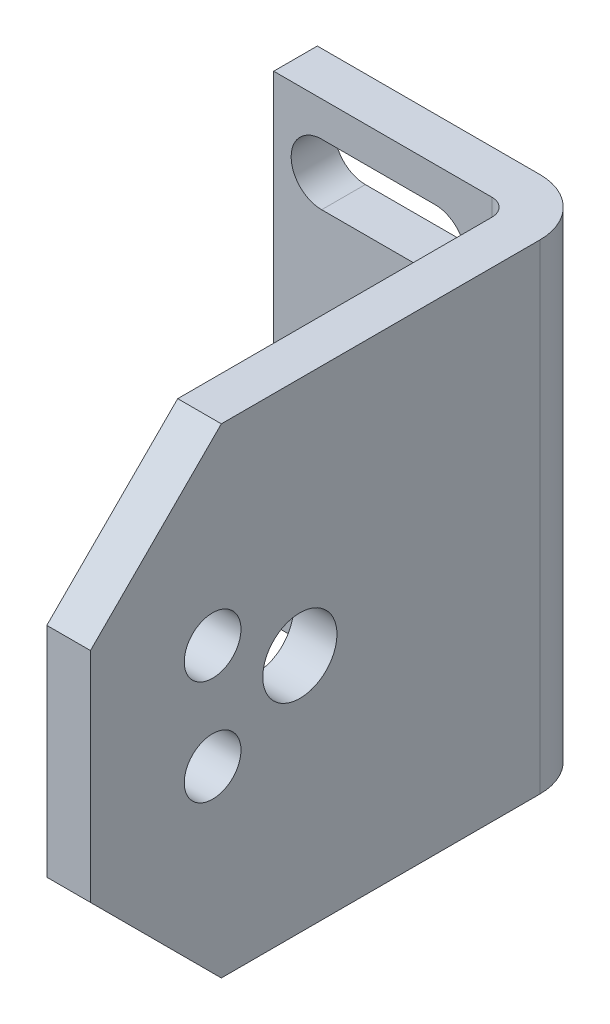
ISO-10303-21;
HEADER;
FILE_DESCRIPTION(('STEP AP214'),'2;1');
FILE_NAME('part.step','',(''),(''),'','','');
FILE_SCHEMA(('AUTOMOTIVE_DESIGN { 1 0 10303 214 1 1 1 1 }'));
ENDSEC;
DATA;
#1=APPLICATION_CONTEXT('core data for automotive mechanical design processes');
#2=APPLICATION_PROTOCOL_DEFINITION('international standard','automotive_design',2000,#1);
#3=PRODUCT_CONTEXT('',#1,'mechanical');
#4=PRODUCT('Part','Part','',(#3));
#5=PRODUCT_RELATED_PRODUCT_CATEGORY('part','',(#4));
#6=PRODUCT_DEFINITION_FORMATION('','',#4);
#7=PRODUCT_DEFINITION_CONTEXT('part definition',#1,'design');
#8=PRODUCT_DEFINITION('design','',#6,#7);
#9=PRODUCT_DEFINITION_SHAPE('','',#8);
#10=(LENGTH_UNIT() NAMED_UNIT(*) SI_UNIT(.MILLI.,.METRE.));
#11=(NAMED_UNIT(*) PLANE_ANGLE_UNIT() SI_UNIT($,.RADIAN.));
#12=(NAMED_UNIT(*) SI_UNIT($,.STERADIAN.) SOLID_ANGLE_UNIT());
#13=UNCERTAINTY_MEASURE_WITH_UNIT(LENGTH_MEASURE(1.E-05),#10,'distance_accuracy_value','');
#14=(GEOMETRIC_REPRESENTATION_CONTEXT(3) GLOBAL_UNCERTAINTY_ASSIGNED_CONTEXT((#13)) GLOBAL_UNIT_ASSIGNED_CONTEXT((#10,
#11,#12)) REPRESENTATION_CONTEXT('',''));
#15=CARTESIAN_POINT('',(0.,0.,0.));
#16=DIRECTION('',(0.,0.,1.));
#17=DIRECTION('',(1.,0.,0.));
#18=AXIS2_PLACEMENT_3D('',#15,#16,#17);
#19=CARTESIAN_POINT('',(21.5,47.5,58.));
#20=DIRECTION('',(0.,0.,-1.));
#21=DIRECTION('',(-1.,0.,0.));
#22=AXIS2_PLACEMENT_3D('',#19,#20,#21);
#23=PLANE('',#22);
#24=DIRECTION('',(0.,-1.,0.));
#25=VECTOR('',#24,1.);
#26=CARTESIAN_POINT('',(26.5,47.5,58.));
#27=LINE('',#26,#25);
#28=CARTESIAN_POINT('',(26.5,32.5,58.));
#29=VERTEX_POINT('',#28);
#30=CARTESIAN_POINT('',(26.5,7.5,58.));
#31=VERTEX_POINT('',#30);
#32=EDGE_CURVE('E252',#29,#31,#27,.T.);
#33=ORIENTED_EDGE('',*,*,#32,.F.);
#34=DIRECTION('',(-1.,0.,0.));
#35=VECTOR('',#34,1.);
#36=CARTESIAN_POINT('',(21.5,32.5,58.));
#37=LINE('',#36,#35);
#38=CARTESIAN_POINT('',(21.5,32.5,58.));
#39=VERTEX_POINT('',#38);
#40=EDGE_CURVE('E265',#29,#39,#37,.T.);
#41=ORIENTED_EDGE('',*,*,#40,.T.);
#42=DIRECTION('',(0.,-1.,0.));
#43=VECTOR('',#42,1.);
#44=CARTESIAN_POINT('',(21.5,47.5,58.));
#45=LINE('',#44,#43);
#46=CARTESIAN_POINT('',(21.5,7.5,58.));
#47=VERTEX_POINT('',#46);
#48=EDGE_CURVE('E217',#39,#47,#45,.T.);
#49=ORIENTED_EDGE('',*,*,#48,.T.);
#50=DIRECTION('',(1.,0.,0.));
#51=VECTOR('',#50,1.);
#52=CARTESIAN_POINT('',(21.5,7.5,58.));
#53=LINE('',#52,#51);
#54=EDGE_CURVE('E262',#47,#31,#53,.T.);
#55=ORIENTED_EDGE('',*,*,#54,.T.);
#56=EDGE_LOOP('',(#33,#41,#49,#55));
#57=FACE_BOUND('',#56,.T.);
#58=ADVANCED_FACE('F14',(#57),#23,.F.);
#59=CARTESIAN_POINT('',(26.5,47.5,58.));
#60=DIRECTION('',(-1.,0.,0.));
#61=DIRECTION('',(0.,0.,1.));
#62=AXIS2_PLACEMENT_3D('',#59,#60,#61);
#63=PLANE('',#62);
#64=CARTESIAN_POINT('',(26.5,14.,44.));
#65=DIRECTION('',(1.,0.,0.));
#66=DIRECTION('',(0.,-1.,0.));
#67=AXIS2_PLACEMENT_3D('',#64,#65,#66);
#68=CIRCLE('',#67,3.25);
#69=CARTESIAN_POINT('',(26.5,10.75,44.));
#70=VERTEX_POINT('',#69);
#71=EDGE_CURVE('E182',#70,#70,#68,.T.);
#72=ORIENTED_EDGE('',*,*,#71,.F.);
#73=EDGE_LOOP('',(#72));
#74=FACE_BOUND('',#73,.T.);
#75=CARTESIAN_POINT('',(26.5,26.,44.));
#76=DIRECTION('',(1.,0.,0.));
#77=DIRECTION('',(0.,1.,0.));
#78=AXIS2_PLACEMENT_3D('',#75,#76,#77);
#79=CIRCLE('',#78,3.25);
#80=CARTESIAN_POINT('',(26.5,29.25,44.));
#81=VERTEX_POINT('',#80);
#82=EDGE_CURVE('E193',#81,#81,#79,.T.);
#83=ORIENTED_EDGE('',*,*,#82,.F.);
#84=EDGE_LOOP('',(#83));
#85=FACE_BOUND('',#84,.T.);
#86=CARTESIAN_POINT('',(26.5,20.,34.));
#87=DIRECTION('',(1.,0.,0.));
#88=DIRECTION('',(0.,1.,0.));
#89=AXIS2_PLACEMENT_3D('',#86,#87,#88);
#90=CIRCLE('',#89,4.25);
#91=CARTESIAN_POINT('',(26.5,24.25,34.));
#92=VERTEX_POINT('',#91);
#93=EDGE_CURVE('E197',#92,#92,#90,.T.);
#94=ORIENTED_EDGE('',*,*,#93,.F.);
#95=EDGE_LOOP('',(#94));
#96=FACE_BOUND('',#95,.T.);
#97=DIRECTION('',(0.,0.,-1.));
#98=VECTOR('',#97,1.);
#99=CARTESIAN_POINT('',(26.5,47.5,58.));
#100=LINE('',#99,#98);
#101=CARTESIAN_POINT('',(26.5,47.5,43.));
#102=VERTEX_POINT('',#101);
#103=CARTESIAN_POINT('',(26.5,47.5,6.5));
#104=VERTEX_POINT('',#103);
#105=EDGE_CURVE('E201',#102,#104,#100,.T.);
#106=ORIENTED_EDGE('',*,*,#105,.F.);
#107=DIRECTION('',(0.,-0.707106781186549,0.707106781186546));
#108=VECTOR('',#107,1.);
#109=CARTESIAN_POINT('',(26.5,47.5,43.));
#110=LINE('',#109,#108);
#111=EDGE_CURVE('E260',#102,#29,#110,.T.);
#112=ORIENTED_EDGE('',*,*,#111,.T.);
#113=ORIENTED_EDGE('',*,*,#32,.T.);
#114=DIRECTION('',(0.,0.707106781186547,0.707106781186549));
#115=VECTOR('',#114,1.);
#116=CARTESIAN_POINT('',(26.5,7.5,58.));
#117=LINE('',#116,#115);
#118=CARTESIAN_POINT('',(26.5,-7.5,43.));
#119=VERTEX_POINT('',#118);
#120=EDGE_CURVE('E258',#31,#119,#117,.F.);
#121=ORIENTED_EDGE('',*,*,#120,.T.);
#122=DIRECTION('',(0.,0.,-1.));
#123=VECTOR('',#122,1.);
#124=CARTESIAN_POINT('',(26.5,-7.5,58.));
#125=LINE('',#124,#123);
#126=CARTESIAN_POINT('',(26.5,-7.5,6.5));
#127=VERTEX_POINT('',#126);
#128=EDGE_CURVE('E218',#119,#127,#125,.T.);
#129=ORIENTED_EDGE('',*,*,#128,.T.);
#130=DIRECTION('',(0.,-1.,0.));
#131=VECTOR('',#130,1.);
#132=CARTESIAN_POINT('',(26.5,47.5,6.5));
#133=LINE('',#132,#131);
#134=EDGE_CURVE('E249',#104,#127,#133,.T.);
#135=ORIENTED_EDGE('',*,*,#134,.F.);
#136=EDGE_LOOP('',(#106,#112,#113,#121,#129,#135));
#137=FACE_BOUND('',#136,.T.);
#138=ADVANCED_FACE('F313',(#74,#85,#96,#137),#63,.F.);
#139=CARTESIAN_POINT('',(20.,47.5,6.5));
#140=DIRECTION('',(0.,-1.,0.));
#141=DIRECTION('',(1.,0.,0.));
#142=AXIS2_PLACEMENT_3D('',#139,#140,#141);
#143=CYLINDRICAL_SURFACE('',#142,6.5);
#144=CARTESIAN_POINT('',(20.,-7.5,6.5));
#145=DIRECTION('',(0.,1.,0.));
#146=DIRECTION('',(-1.,0.,0.));
#147=AXIS2_PLACEMENT_3D('',#144,#145,#146);
#148=CIRCLE('',#147,6.5);
#149=CARTESIAN_POINT('',(20.,-7.5,0.));
#150=VERTEX_POINT('',#149);
#151=EDGE_CURVE('E220',#127,#150,#148,.T.);
#152=ORIENTED_EDGE('',*,*,#151,.T.);
#153=DIRECTION('',(0.,-1.,0.));
#154=VECTOR('',#153,1.);
#155=CARTESIAN_POINT('',(20.,47.5,0.));
#156=LINE('',#155,#154);
#157=CARTESIAN_POINT('',(20.,47.5,0.));
#158=VERTEX_POINT('',#157);
#159=EDGE_CURVE('E246',#158,#150,#156,.T.);
#160=ORIENTED_EDGE('',*,*,#159,.F.);
#161=CARTESIAN_POINT('',(20.,47.5,6.5));
#162=DIRECTION('',(0.,1.,0.));
#163=DIRECTION('',(-1.,0.,0.));
#164=AXIS2_PLACEMENT_3D('',#161,#162,#163);
#165=CIRCLE('',#164,6.5);
#166=EDGE_CURVE('E203',#104,#158,#165,.T.);
#167=ORIENTED_EDGE('',*,*,#166,.F.);
#168=ORIENTED_EDGE('',*,*,#134,.T.);
#169=EDGE_LOOP('',(#152,#160,#167,#168));
#170=FACE_BOUND('',#169,.T.);
#171=ADVANCED_FACE('F320',(#170),#143,.T.);
#172=CARTESIAN_POINT('',(20.,47.5,0.));
#173=DIRECTION('',(0.,0.,1.));
#174=DIRECTION('',(1.,0.,0.));
#175=AXIS2_PLACEMENT_3D('',#172,#173,#174);
#176=PLANE('',#175);
#177=DIRECTION('',(-1.,0.,0.));
#178=VECTOR('',#177,1.);
#179=CARTESIAN_POINT('',(13.,3.5,0.));
#180=LINE('',#179,#178);
#181=CARTESIAN_POINT('',(13.,3.5,0.));
#182=VERTEX_POINT('',#181);
#183=CARTESIAN_POINT('',(0.,3.5,0.));
#184=VERTEX_POINT('',#183);
#185=EDGE_CURVE('E146',#182,#184,#180,.T.);
#186=ORIENTED_EDGE('',*,*,#185,.T.);
#187=CARTESIAN_POINT('',(0.,0.,0.));
#188=DIRECTION('',(0.,0.,1.));
#189=DIRECTION('',(-1.,0.,0.));
#190=AXIS2_PLACEMENT_3D('',#187,#188,#189);
#191=CIRCLE('',#190,3.5);
#192=CARTESIAN_POINT('',(0.,-3.5,0.));
#193=VERTEX_POINT('',#192);
#194=EDGE_CURVE('E142',#184,#193,#191,.T.);
#195=ORIENTED_EDGE('',*,*,#194,.T.);
#196=DIRECTION('',(1.,0.,0.));
#197=VECTOR('',#196,1.);
#198=CARTESIAN_POINT('',(13.,-3.5,0.));
#199=LINE('',#198,#197);
#200=CARTESIAN_POINT('',(13.,-3.5,0.));
#201=VERTEX_POINT('',#200);
#202=EDGE_CURVE('E149',#193,#201,#199,.T.);
#203=ORIENTED_EDGE('',*,*,#202,.T.);
#204=CARTESIAN_POINT('',(13.,0.,0.));
#205=DIRECTION('',(0.,0.,1.));
#206=DIRECTION('',(-1.,0.,0.));
#207=AXIS2_PLACEMENT_3D('',#204,#205,#206);
#208=CIRCLE('',#207,3.5);
#209=EDGE_CURVE('E29',#201,#182,#208,.T.);
#210=ORIENTED_EDGE('',*,*,#209,.T.);
#211=EDGE_LOOP('',(#186,#195,#203,#210));
#212=FACE_BOUND('',#211,.T.);
#213=DIRECTION('',(1.,0.,0.));
#214=VECTOR('',#213,1.);
#215=CARTESIAN_POINT('',(13.,36.5,0.));
#216=LINE('',#215,#214);
#217=CARTESIAN_POINT('',(0.,36.5,0.));
#218=VERTEX_POINT('',#217);
#219=CARTESIAN_POINT('',(13.,36.5,0.));
#220=VERTEX_POINT('',#219);
#221=EDGE_CURVE('E175',#218,#220,#216,.T.);
#222=ORIENTED_EDGE('',*,*,#221,.T.);
#223=CARTESIAN_POINT('',(13.,40.,0.));
#224=DIRECTION('',(0.,0.,1.));
#225=DIRECTION('',(1.,0.,0.));
#226=AXIS2_PLACEMENT_3D('',#223,#224,#225);
#227=CIRCLE('',#226,3.5);
#228=CARTESIAN_POINT('',(13.,43.5,0.));
#229=VERTEX_POINT('',#228);
#230=EDGE_CURVE('E162',#220,#229,#227,.T.);
#231=ORIENTED_EDGE('',*,*,#230,.T.);
#232=DIRECTION('',(-1.,0.,0.));
#233=VECTOR('',#232,1.);
#234=CARTESIAN_POINT('',(13.,43.5,0.));
#235=LINE('',#234,#233);
#236=CARTESIAN_POINT('',(0.,43.5,0.));
#237=VERTEX_POINT('',#236);
#238=EDGE_CURVE('E169',#229,#237,#235,.T.);
#239=ORIENTED_EDGE('',*,*,#238,.T.);
#240=CARTESIAN_POINT('',(0.,40.,0.));
#241=DIRECTION('',(0.,0.,1.));
#242=DIRECTION('',(1.,0.,0.));
#243=AXIS2_PLACEMENT_3D('',#240,#241,#242);
#244=CIRCLE('',#243,3.5);
#245=EDGE_CURVE('E172',#237,#218,#244,.T.);
#246=ORIENTED_EDGE('',*,*,#245,.T.);
#247=EDGE_LOOP('',(#222,#231,#239,#246));
#248=FACE_BOUND('',#247,.T.);
#249=DIRECTION('',(-1.,0.,0.));
#250=VECTOR('',#249,1.);
#251=CARTESIAN_POINT('',(20.,-7.5,0.));
#252=LINE('',#251,#250);
#253=CARTESIAN_POINT('',(-5.5,-7.5,0.));
#254=VERTEX_POINT('',#253);
#255=EDGE_CURVE('E222',#150,#254,#252,.T.);
#256=ORIENTED_EDGE('',*,*,#255,.T.);
#257=DIRECTION('',(0.,-1.,0.));
#258=VECTOR('',#257,1.);
#259=CARTESIAN_POINT('',(-5.5,47.5,0.));
#260=LINE('',#259,#258);
#261=CARTESIAN_POINT('',(-5.5,47.5,0.));
#262=VERTEX_POINT('',#261);
#263=EDGE_CURVE('E243',#262,#254,#260,.T.);
#264=ORIENTED_EDGE('',*,*,#263,.F.);
#265=DIRECTION('',(-1.,0.,0.));
#266=VECTOR('',#265,1.);
#267=CARTESIAN_POINT('',(20.,47.5,0.));
#268=LINE('',#267,#266);
#269=EDGE_CURVE('E206',#158,#262,#268,.T.);
#270=ORIENTED_EDGE('',*,*,#269,.F.);
#271=ORIENTED_EDGE('',*,*,#159,.T.);
#272=EDGE_LOOP('',(#256,#264,#270,#271));
#273=FACE_BOUND('',#272,.T.);
#274=ADVANCED_FACE('F153',(#212,#248,#273),#176,.F.);
#275=CARTESIAN_POINT('',(-5.5,47.5,0.));
#276=DIRECTION('',(1.,0.,0.));
#277=DIRECTION('',(0.,1.,0.));
#278=AXIS2_PLACEMENT_3D('',#275,#276,#277);
#279=PLANE('',#278);
#280=DIRECTION('',(0.,0.,1.));
#281=VECTOR('',#280,1.);
#282=CARTESIAN_POINT('',(-5.5,-7.5,0.));
#283=LINE('',#282,#281);
#284=CARTESIAN_POINT('',(-5.5,-7.5,5.));
#285=VERTEX_POINT('',#284);
#286=EDGE_CURVE('E224',#254,#285,#283,.T.);
#287=ORIENTED_EDGE('',*,*,#286,.T.);
#288=DIRECTION('',(0.,-1.,0.));
#289=VECTOR('',#288,1.);
#290=CARTESIAN_POINT('',(-5.5,47.5,5.));
#291=LINE('',#290,#289);
#292=CARTESIAN_POINT('',(-5.5,47.5,5.));
#293=VERTEX_POINT('',#292);
#294=EDGE_CURVE('E240',#293,#285,#291,.T.);
#295=ORIENTED_EDGE('',*,*,#294,.F.);
#296=DIRECTION('',(0.,0.,1.));
#297=VECTOR('',#296,1.);
#298=CARTESIAN_POINT('',(-5.5,47.5,0.));
#299=LINE('',#298,#297);
#300=EDGE_CURVE('E208',#262,#293,#299,.T.);
#301=ORIENTED_EDGE('',*,*,#300,.F.);
#302=ORIENTED_EDGE('',*,*,#263,.T.);
#303=EDGE_LOOP('',(#287,#295,#301,#302));
#304=FACE_BOUND('',#303,.T.);
#305=ADVANCED_FACE('F375',(#304),#279,.F.);
#306=CARTESIAN_POINT('',(-5.5,47.5,5.));
#307=DIRECTION('',(0.,0.,-1.));
#308=DIRECTION('',(-1.,0.,0.));
#309=AXIS2_PLACEMENT_3D('',#306,#307,#308);
#310=PLANE('',#309);
#311=DIRECTION('',(-1.,0.,0.));
#312=VECTOR('',#311,1.);
#313=CARTESIAN_POINT('',(-5.5,-3.5,5.));
#314=LINE('',#313,#312);
#315=CARTESIAN_POINT('',(13.,-3.5,5.));
#316=VERTEX_POINT('',#315);
#317=CARTESIAN_POINT('',(0.,-3.5,5.));
#318=VERTEX_POINT('',#317);
#319=EDGE_CURVE('E291',#316,#318,#314,.T.);
#320=ORIENTED_EDGE('',*,*,#319,.T.);
#321=CARTESIAN_POINT('',(0.,0.,5.));
#322=DIRECTION('',(0.,0.,-1.));
#323=DIRECTION('',(-1.,0.,0.));
#324=AXIS2_PLACEMENT_3D('',#321,#322,#323);
#325=CIRCLE('',#324,3.5);
#326=CARTESIAN_POINT('',(0.,3.5,5.));
#327=VERTEX_POINT('',#326);
#328=EDGE_CURVE('E9',#318,#327,#325,.T.);
#329=ORIENTED_EDGE('',*,*,#328,.T.);
#330=DIRECTION('',(1.,0.,0.));
#331=VECTOR('',#330,1.);
#332=CARTESIAN_POINT('',(-5.5,3.5,5.));
#333=LINE('',#332,#331);
#334=CARTESIAN_POINT('',(13.,3.5,5.));
#335=VERTEX_POINT('',#334);
#336=EDGE_CURVE('E22',#327,#335,#333,.T.);
#337=ORIENTED_EDGE('',*,*,#336,.T.);
#338=CARTESIAN_POINT('',(13.,0.,5.));
#339=DIRECTION('',(0.,0.,-1.));
#340=DIRECTION('',(-1.,0.,0.));
#341=AXIS2_PLACEMENT_3D('',#338,#339,#340);
#342=CIRCLE('',#341,3.5);
#343=EDGE_CURVE('E293',#335,#316,#342,.T.);
#344=ORIENTED_EDGE('',*,*,#343,.T.);
#345=EDGE_LOOP('',(#320,#329,#337,#344));
#346=FACE_BOUND('',#345,.T.);
#347=DIRECTION('',(1.,0.,0.));
#348=VECTOR('',#347,1.);
#349=CARTESIAN_POINT('',(-5.5,43.5,5.));
#350=LINE('',#349,#348);
#351=CARTESIAN_POINT('',(0.,43.5,5.));
#352=VERTEX_POINT('',#351);
#353=CARTESIAN_POINT('',(13.,43.5,5.));
#354=VERTEX_POINT('',#353);
#355=EDGE_CURVE('E273',#352,#354,#350,.T.);
#356=ORIENTED_EDGE('',*,*,#355,.T.);
#357=CARTESIAN_POINT('',(13.,40.,5.));
#358=DIRECTION('',(0.,0.,-1.));
#359=DIRECTION('',(-1.,0.,0.));
#360=AXIS2_PLACEMENT_3D('',#357,#358,#359);
#361=CIRCLE('',#360,3.5);
#362=CARTESIAN_POINT('',(13.,36.5,5.));
#363=VERTEX_POINT('',#362);
#364=EDGE_CURVE('E288',#354,#363,#361,.T.);
#365=ORIENTED_EDGE('',*,*,#364,.T.);
#366=DIRECTION('',(-1.,0.,0.));
#367=VECTOR('',#366,1.);
#368=CARTESIAN_POINT('',(-5.5,36.5,5.));
#369=LINE('',#368,#367);
#370=CARTESIAN_POINT('',(0.,36.5,5.));
#371=VERTEX_POINT('',#370);
#372=EDGE_CURVE('E285',#363,#371,#369,.T.);
#373=ORIENTED_EDGE('',*,*,#372,.T.);
#374=CARTESIAN_POINT('',(0.,40.,5.));
#375=DIRECTION('',(0.,0.,-1.));
#376=DIRECTION('',(-1.,0.,0.));
#377=AXIS2_PLACEMENT_3D('',#374,#375,#376);
#378=CIRCLE('',#377,3.5);
#379=EDGE_CURVE('E282',#371,#352,#378,.T.);
#380=ORIENTED_EDGE('',*,*,#379,.T.);
#381=EDGE_LOOP('',(#356,#365,#373,#380));
#382=FACE_BOUND('',#381,.T.);
#383=DIRECTION('',(1.,0.,0.));
#384=VECTOR('',#383,1.);
#385=CARTESIAN_POINT('',(-5.5,-7.5,5.));
#386=LINE('',#385,#384);
#387=CARTESIAN_POINT('',(19.5,-7.5,5.));
#388=VERTEX_POINT('',#387);
#389=EDGE_CURVE('E226',#285,#388,#386,.T.);
#390=ORIENTED_EDGE('',*,*,#389,.T.);
#391=DIRECTION('',(0.,-1.,0.));
#392=VECTOR('',#391,1.);
#393=CARTESIAN_POINT('',(19.5,47.5,5.));
#394=LINE('',#393,#392);
#395=CARTESIAN_POINT('',(19.5,47.5,5.));
#396=VERTEX_POINT('',#395);
#397=EDGE_CURVE('E237',#396,#388,#394,.T.);
#398=ORIENTED_EDGE('',*,*,#397,.F.);
#399=DIRECTION('',(1.,0.,0.));
#400=VECTOR('',#399,1.);
#401=CARTESIAN_POINT('',(-5.5,47.5,5.));
#402=LINE('',#401,#400);
#403=EDGE_CURVE('E210',#293,#396,#402,.T.);
#404=ORIENTED_EDGE('',*,*,#403,.F.);
#405=ORIENTED_EDGE('',*,*,#294,.T.);
#406=EDGE_LOOP('',(#390,#398,#404,#405));
#407=FACE_BOUND('',#406,.T.);
#408=ADVANCED_FACE('F297',(#346,#382,#407),#310,.F.);
#409=CARTESIAN_POINT('',(19.5,47.5,7.));
#410=DIRECTION('',(0.,-1.,0.));
#411=DIRECTION('',(1.,0.,0.));
#412=AXIS2_PLACEMENT_3D('',#409,#410,#411);
#413=CYLINDRICAL_SURFACE('',#412,2.);
#414=CARTESIAN_POINT('',(19.5,-7.5,7.));
#415=DIRECTION('',(0.,-1.,0.));
#416=DIRECTION('',(-1.,0.,0.));
#417=AXIS2_PLACEMENT_3D('',#414,#415,#416);
#418=CIRCLE('',#417,2.);
#419=CARTESIAN_POINT('',(21.5,-7.5,7.));
#420=VERTEX_POINT('',#419);
#421=EDGE_CURVE('E228',#388,#420,#418,.T.);
#422=ORIENTED_EDGE('',*,*,#421,.T.);
#423=DIRECTION('',(0.,-1.,0.));
#424=VECTOR('',#423,1.);
#425=CARTESIAN_POINT('',(21.5,47.5,7.));
#426=LINE('',#425,#424);
#427=CARTESIAN_POINT('',(21.5,47.5,7.));
#428=VERTEX_POINT('',#427);
#429=EDGE_CURVE('E234',#428,#420,#426,.T.);
#430=ORIENTED_EDGE('',*,*,#429,.F.);
#431=CARTESIAN_POINT('',(19.5,47.5,7.));
#432=DIRECTION('',(0.,-1.,0.));
#433=DIRECTION('',(-1.,0.,0.));
#434=AXIS2_PLACEMENT_3D('',#431,#432,#433);
#435=CIRCLE('',#434,2.);
#436=EDGE_CURVE('E212',#396,#428,#435,.T.);
#437=ORIENTED_EDGE('',*,*,#436,.F.);
#438=ORIENTED_EDGE('',*,*,#397,.T.);
#439=EDGE_LOOP('',(#422,#430,#437,#438));
#440=FACE_BOUND('',#439,.T.);
#441=ADVANCED_FACE('F353',(#440),#413,.F.);
#442=CARTESIAN_POINT('',(21.5,47.5,7.));
#443=DIRECTION('',(1.,0.,0.));
#444=DIRECTION('',(0.,0.,-1.));
#445=AXIS2_PLACEMENT_3D('',#442,#443,#444);
#446=PLANE('',#445);
#447=CARTESIAN_POINT('',(21.5,14.,44.));
#448=DIRECTION('',(1.,0.,0.));
#449=DIRECTION('',(0.,0.,-1.));
#450=AXIS2_PLACEMENT_3D('',#447,#448,#449);
#451=CIRCLE('',#450,3.25);
#452=CARTESIAN_POINT('',(21.5,14.,40.75));
#453=VERTEX_POINT('',#452);
#454=EDGE_CURVE('E192',#453,#453,#451,.T.);
#455=ORIENTED_EDGE('',*,*,#454,.T.);
#456=EDGE_LOOP('',(#455));
#457=FACE_BOUND('',#456,.T.);
#458=CARTESIAN_POINT('',(21.5,26.,44.));
#459=DIRECTION('',(1.,0.,0.));
#460=DIRECTION('',(0.,0.,-1.));
#461=AXIS2_PLACEMENT_3D('',#458,#459,#460);
#462=CIRCLE('',#461,3.25);
#463=CARTESIAN_POINT('',(21.5,26.,40.75));
#464=VERTEX_POINT('',#463);
#465=EDGE_CURVE('E196',#464,#464,#462,.T.);
#466=ORIENTED_EDGE('',*,*,#465,.T.);
#467=EDGE_LOOP('',(#466));
#468=FACE_BOUND('',#467,.T.);
#469=CARTESIAN_POINT('',(21.5,20.,34.));
#470=DIRECTION('',(1.,0.,0.));
#471=DIRECTION('',(0.,0.,-1.));
#472=AXIS2_PLACEMENT_3D('',#469,#470,#471);
#473=CIRCLE('',#472,4.25);
#474=CARTESIAN_POINT('',(21.5,20.,29.75));
#475=VERTEX_POINT('',#474);
#476=EDGE_CURVE('E200',#475,#475,#473,.T.);
#477=ORIENTED_EDGE('',*,*,#476,.T.);
#478=EDGE_LOOP('',(#477));
#479=FACE_BOUND('',#478,.T.);
#480=ORIENTED_EDGE('',*,*,#48,.F.);
#481=DIRECTION('',(0.,0.707106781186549,-0.707106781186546));
#482=VECTOR('',#481,1.);
#483=CARTESIAN_POINT('',(21.5,47.5,43.));
#484=LINE('',#483,#482);
#485=CARTESIAN_POINT('',(21.5,47.5,43.));
#486=VERTEX_POINT('',#485);
#487=EDGE_CURVE('E269',#39,#486,#484,.T.);
#488=ORIENTED_EDGE('',*,*,#487,.T.);
#489=DIRECTION('',(0.,0.,1.));
#490=VECTOR('',#489,1.);
#491=CARTESIAN_POINT('',(21.5,47.5,7.));
#492=LINE('',#491,#490);
#493=EDGE_CURVE('E214',#428,#486,#492,.T.);
#494=ORIENTED_EDGE('',*,*,#493,.F.);
#495=ORIENTED_EDGE('',*,*,#429,.T.);
#496=DIRECTION('',(0.,0.,1.));
#497=VECTOR('',#496,1.);
#498=CARTESIAN_POINT('',(21.5,-7.5,7.));
#499=LINE('',#498,#497);
#500=CARTESIAN_POINT('',(21.5,-7.5,43.));
#501=VERTEX_POINT('',#500);
#502=EDGE_CURVE('E204',#420,#501,#499,.T.);
#503=ORIENTED_EDGE('',*,*,#502,.T.);
#504=DIRECTION('',(0.,-0.707106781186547,-0.707106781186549));
#505=VECTOR('',#504,1.);
#506=CARTESIAN_POINT('',(21.5,7.5,58.));
#507=LINE('',#506,#505);
#508=EDGE_CURVE('E267',#501,#47,#507,.F.);
#509=ORIENTED_EDGE('',*,*,#508,.T.);
#510=EDGE_LOOP('',(#480,#488,#494,#495,#503,#509));
#511=FACE_BOUND('',#510,.T.);
#512=ADVANCED_FACE('F345',(#457,#468,#479,#511),#446,.F.);
#513=CARTESIAN_POINT('',(20.,47.5,6.5));
#514=DIRECTION('',(0.,1.,0.));
#515=DIRECTION('',(-1.,0.,0.));
#516=AXIS2_PLACEMENT_3D('',#513,#514,#515);
#517=PLANE('',#516);
#518=ORIENTED_EDGE('',*,*,#493,.T.);
#519=DIRECTION('',(1.,0.,0.));
#520=VECTOR('',#519,1.);
#521=CARTESIAN_POINT('',(26.5,47.5,43.));
#522=LINE('',#521,#520);
#523=EDGE_CURVE('E255',#486,#102,#522,.T.);
#524=ORIENTED_EDGE('',*,*,#523,.T.);
#525=ORIENTED_EDGE('',*,*,#105,.T.);
#526=ORIENTED_EDGE('',*,*,#166,.T.);
#527=ORIENTED_EDGE('',*,*,#269,.T.);
#528=ORIENTED_EDGE('',*,*,#300,.T.);
#529=ORIENTED_EDGE('',*,*,#403,.T.);
#530=ORIENTED_EDGE('',*,*,#436,.T.);
#531=EDGE_LOOP('',(#518,#524,#525,#526,#527,#528,#529,#530));
#532=FACE_BOUND('',#531,.T.);
#533=ADVANCED_FACE('F336',(#532),#517,.T.);
#534=CARTESIAN_POINT('',(20.,-7.5,6.5));
#535=DIRECTION('',(0.,1.,0.));
#536=DIRECTION('',(-1.,0.,0.));
#537=AXIS2_PLACEMENT_3D('',#534,#535,#536);
#538=PLANE('',#537);
#539=ORIENTED_EDGE('',*,*,#128,.F.);
#540=DIRECTION('',(-1.,0.,0.));
#541=VECTOR('',#540,1.);
#542=CARTESIAN_POINT('',(20.,-7.5,43.));
#543=LINE('',#542,#541);
#544=EDGE_CURVE('E271',#119,#501,#543,.T.);
#545=ORIENTED_EDGE('',*,*,#544,.T.);
#546=ORIENTED_EDGE('',*,*,#502,.F.);
#547=ORIENTED_EDGE('',*,*,#421,.F.);
#548=ORIENTED_EDGE('',*,*,#389,.F.);
#549=ORIENTED_EDGE('',*,*,#286,.F.);
#550=ORIENTED_EDGE('',*,*,#255,.F.);
#551=ORIENTED_EDGE('',*,*,#151,.F.);
#552=EDGE_LOOP('',(#539,#545,#546,#547,#548,#549,#550,#551));
#553=FACE_BOUND('',#552,.T.);
#554=ADVANCED_FACE('F327',(#553),#538,.F.);
#555=CARTESIAN_POINT('',(20.,47.5,43.));
#556=DIRECTION('',(0.,0.707106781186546,0.707106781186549));
#557=DIRECTION('',(0.,-0.707106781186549,0.707106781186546));
#558=AXIS2_PLACEMENT_3D('',#555,#556,#557);
#559=PLANE('',#558);
#560=ORIENTED_EDGE('',*,*,#487,.F.);
#561=ORIENTED_EDGE('',*,*,#40,.F.);
#562=ORIENTED_EDGE('',*,*,#111,.F.);
#563=ORIENTED_EDGE('',*,*,#523,.F.);
#564=EDGE_LOOP('',(#560,#561,#562,#563));
#565=FACE_BOUND('',#564,.T.);
#566=ADVANCED_FACE('F325',(#565),#559,.T.);
#567=CARTESIAN_POINT('',(21.5,7.5,58.));
#568=DIRECTION('',(0.,0.707106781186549,-0.707106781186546));
#569=DIRECTION('',(0.,0.707106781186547,0.707106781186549));
#570=AXIS2_PLACEMENT_3D('',#567,#568,#569);
#571=PLANE('',#570);
#572=ORIENTED_EDGE('',*,*,#508,.F.);
#573=ORIENTED_EDGE('',*,*,#544,.F.);
#574=ORIENTED_EDGE('',*,*,#120,.F.);
#575=ORIENTED_EDGE('',*,*,#54,.F.);
#576=EDGE_LOOP('',(#572,#573,#574,#575));
#577=FACE_BOUND('',#576,.T.);
#578=ADVANCED_FACE('F16',(#577),#571,.F.);
#579=CARTESIAN_POINT('',(-5.5,20.,34.));
#580=DIRECTION('',(1.,0.,0.));
#581=DIRECTION('',(0.,1.,0.));
#582=AXIS2_PLACEMENT_3D('',#579,#580,#581);
#583=CYLINDRICAL_SURFACE('',#582,4.25);
#584=ORIENTED_EDGE('',*,*,#93,.T.);
#585=EDGE_LOOP('',(#584));
#586=FACE_BOUND('',#585,.T.);
#587=ORIENTED_EDGE('',*,*,#476,.F.);
#588=EDGE_LOOP('',(#587));
#589=FACE_BOUND('',#588,.T.);
#590=ADVANCED_FACE('F334',(#586,#589),#583,.F.);
#591=CARTESIAN_POINT('',(-5.5,26.,44.));
#592=DIRECTION('',(1.,0.,0.));
#593=DIRECTION('',(0.,1.,0.));
#594=AXIS2_PLACEMENT_3D('',#591,#592,#593);
#595=CYLINDRICAL_SURFACE('',#594,3.25);
#596=ORIENTED_EDGE('',*,*,#82,.T.);
#597=EDGE_LOOP('',(#596));
#598=FACE_BOUND('',#597,.T.);
#599=ORIENTED_EDGE('',*,*,#465,.F.);
#600=EDGE_LOOP('',(#599));
#601=FACE_BOUND('',#600,.T.);
#602=ADVANCED_FACE('F517',(#598,#601),#595,.F.);
#603=CARTESIAN_POINT('',(-5.5,14.,44.));
#604=DIRECTION('',(1.,0.,0.));
#605=DIRECTION('',(0.,1.,0.));
#606=AXIS2_PLACEMENT_3D('',#603,#604,#605);
#607=CYLINDRICAL_SURFACE('',#606,3.25);
#608=ORIENTED_EDGE('',*,*,#71,.T.);
#609=EDGE_LOOP('',(#608));
#610=FACE_BOUND('',#609,.T.);
#611=ORIENTED_EDGE('',*,*,#454,.F.);
#612=EDGE_LOOP('',(#611));
#613=FACE_BOUND('',#612,.T.);
#614=ADVANCED_FACE('F508',(#610,#613),#607,.F.);
#615=CARTESIAN_POINT('',(13.,40.,0.));
#616=DIRECTION('',(0.,0.,1.));
#617=DIRECTION('',(1.,0.,0.));
#618=AXIS2_PLACEMENT_3D('',#615,#616,#617);
#619=CYLINDRICAL_SURFACE('',#618,3.5);
#620=DIRECTION('',(0.,0.,1.));
#621=VECTOR('',#620,1.);
#622=CARTESIAN_POINT('',(13.,43.5,0.));
#623=LINE('',#622,#621);
#624=EDGE_CURVE('E178',#229,#354,#623,.T.);
#625=ORIENTED_EDGE('',*,*,#624,.F.);
#626=ORIENTED_EDGE('',*,*,#230,.F.);
#627=DIRECTION('',(0.,0.,1.));
#628=VECTOR('',#627,1.);
#629=CARTESIAN_POINT('',(13.,36.5,0.));
#630=LINE('',#629,#628);
#631=EDGE_CURVE('E179',#220,#363,#630,.T.);
#632=ORIENTED_EDGE('',*,*,#631,.T.);
#633=ORIENTED_EDGE('',*,*,#364,.F.);
#634=EDGE_LOOP('',(#625,#626,#632,#633));
#635=FACE_BOUND('',#634,.T.);
#636=ADVANCED_FACE('F499',(#635),#619,.F.);
#637=CARTESIAN_POINT('',(13.,36.5,0.));
#638=DIRECTION('',(0.,-1.,0.));
#639=DIRECTION('',(1.,0.,0.));
#640=AXIS2_PLACEMENT_3D('',#637,#638,#639);
#641=PLANE('',#640);
#642=ORIENTED_EDGE('',*,*,#631,.F.);
#643=ORIENTED_EDGE('',*,*,#221,.F.);
#644=DIRECTION('',(0.,0.,1.));
#645=VECTOR('',#644,1.);
#646=CARTESIAN_POINT('',(0.,36.5,0.));
#647=LINE('',#646,#645);
#648=EDGE_CURVE('E183',#218,#371,#647,.T.);
#649=ORIENTED_EDGE('',*,*,#648,.T.);
#650=ORIENTED_EDGE('',*,*,#372,.F.);
#651=EDGE_LOOP('',(#642,#643,#649,#650));
#652=FACE_BOUND('',#651,.T.);
#653=ADVANCED_FACE('F490',(#652),#641,.F.);
#654=CARTESIAN_POINT('',(0.,40.,0.));
#655=DIRECTION('',(0.,0.,1.));
#656=DIRECTION('',(1.,0.,0.));
#657=AXIS2_PLACEMENT_3D('',#654,#655,#656);
#658=CYLINDRICAL_SURFACE('',#657,3.5);
#659=ORIENTED_EDGE('',*,*,#648,.F.);
#660=ORIENTED_EDGE('',*,*,#245,.F.);
#661=DIRECTION('',(0.,0.,1.));
#662=VECTOR('',#661,1.);
#663=CARTESIAN_POINT('',(0.,43.5,0.));
#664=LINE('',#663,#662);
#665=EDGE_CURVE('E186',#237,#352,#664,.T.);
#666=ORIENTED_EDGE('',*,*,#665,.T.);
#667=ORIENTED_EDGE('',*,*,#379,.F.);
#668=EDGE_LOOP('',(#659,#660,#666,#667));
#669=FACE_BOUND('',#668,.T.);
#670=ADVANCED_FACE('F481',(#669),#658,.F.);
#671=CARTESIAN_POINT('',(13.,43.5,0.));
#672=DIRECTION('',(0.,1.,0.));
#673=DIRECTION('',(-1.,0.,0.));
#674=AXIS2_PLACEMENT_3D('',#671,#672,#673);
#675=PLANE('',#674);
#676=ORIENTED_EDGE('',*,*,#665,.F.);
#677=ORIENTED_EDGE('',*,*,#238,.F.);
#678=ORIENTED_EDGE('',*,*,#624,.T.);
#679=ORIENTED_EDGE('',*,*,#355,.F.);
#680=EDGE_LOOP('',(#676,#677,#678,#679));
#681=FACE_BOUND('',#680,.T.);
#682=ADVANCED_FACE('F474',(#681),#675,.F.);
#683=CARTESIAN_POINT('',(0.,0.,0.));
#684=DIRECTION('',(0.,0.,1.));
#685=DIRECTION('',(1.,0.,0.));
#686=AXIS2_PLACEMENT_3D('',#683,#684,#685);
#687=CYLINDRICAL_SURFACE('',#686,3.5);
#688=DIRECTION('',(0.,0.,1.));
#689=VECTOR('',#688,1.);
#690=CARTESIAN_POINT('',(0.,-3.5,0.));
#691=LINE('',#690,#689);
#692=EDGE_CURVE('E37',#193,#318,#691,.T.);
#693=ORIENTED_EDGE('',*,*,#692,.F.);
#694=ORIENTED_EDGE('',*,*,#194,.F.);
#695=DIRECTION('',(0.,0.,1.));
#696=VECTOR('',#695,1.);
#697=CARTESIAN_POINT('',(0.,3.5,0.));
#698=LINE('',#697,#696);
#699=EDGE_CURVE('E160',#184,#327,#698,.T.);
#700=ORIENTED_EDGE('',*,*,#699,.T.);
#701=ORIENTED_EDGE('',*,*,#328,.F.);
#702=EDGE_LOOP('',(#693,#694,#700,#701));
#703=FACE_BOUND('',#702,.T.);
#704=ADVANCED_FACE('F139',(#703),#687,.F.);
#705=CARTESIAN_POINT('',(13.,3.5,0.));
#706=DIRECTION('',(0.,1.,0.));
#707=DIRECTION('',(-1.,0.,0.));
#708=AXIS2_PLACEMENT_3D('',#705,#706,#707);
#709=PLANE('',#708);
#710=ORIENTED_EDGE('',*,*,#699,.F.);
#711=ORIENTED_EDGE('',*,*,#185,.F.);
#712=DIRECTION('',(0.,0.,1.));
#713=VECTOR('',#712,1.);
#714=CARTESIAN_POINT('',(13.,3.5,0.));
#715=LINE('',#714,#713);
#716=EDGE_CURVE('E163',#182,#335,#715,.T.);
#717=ORIENTED_EDGE('',*,*,#716,.T.);
#718=ORIENTED_EDGE('',*,*,#336,.F.);
#719=EDGE_LOOP('',(#710,#711,#717,#718));
#720=FACE_BOUND('',#719,.T.);
#721=ADVANCED_FACE('F300',(#720),#709,.F.);
#722=CARTESIAN_POINT('',(13.,0.,0.));
#723=DIRECTION('',(0.,0.,1.));
#724=DIRECTION('',(1.,0.,0.));
#725=AXIS2_PLACEMENT_3D('',#722,#723,#724);
#726=CYLINDRICAL_SURFACE('',#725,3.5);
#727=ORIENTED_EDGE('',*,*,#716,.F.);
#728=ORIENTED_EDGE('',*,*,#209,.F.);
#729=DIRECTION('',(0.,0.,1.));
#730=VECTOR('',#729,1.);
#731=CARTESIAN_POINT('',(13.,-3.5,0.));
#732=LINE('',#731,#730);
#733=EDGE_CURVE('E145',#201,#316,#732,.T.);
#734=ORIENTED_EDGE('',*,*,#733,.T.);
#735=ORIENTED_EDGE('',*,*,#343,.F.);
#736=EDGE_LOOP('',(#727,#728,#734,#735));
#737=FACE_BOUND('',#736,.T.);
#738=ADVANCED_FACE('F301',(#737),#726,.F.);
#739=CARTESIAN_POINT('',(13.,-3.5,0.));
#740=DIRECTION('',(0.,-1.,0.));
#741=DIRECTION('',(1.,0.,0.));
#742=AXIS2_PLACEMENT_3D('',#739,#740,#741);
#743=PLANE('',#742);
#744=ORIENTED_EDGE('',*,*,#733,.F.);
#745=ORIENTED_EDGE('',*,*,#202,.F.);
#746=ORIENTED_EDGE('',*,*,#692,.T.);
#747=ORIENTED_EDGE('',*,*,#319,.F.);
#748=EDGE_LOOP('',(#744,#745,#746,#747));
#749=FACE_BOUND('',#748,.T.);
#750=ADVANCED_FACE('F150',(#749),#743,.F.);
#751=CLOSED_SHELL('',(#58,#138,#171,#274,#305,#408,#441,#512,#533,#554,#566,#578,#590,#602,#614,
#636,#653,#670,#682,#704,#721,#738,#750));
#752=MANIFOLD_SOLID_BREP('B1',#751);
#753=ADVANCED_BREP_SHAPE_REPRESENTATION('',(#18,#752),#14);
#754=SHAPE_DEFINITION_REPRESENTATION(#9,#753);
ENDSEC;
END-ISO-10303-21;
